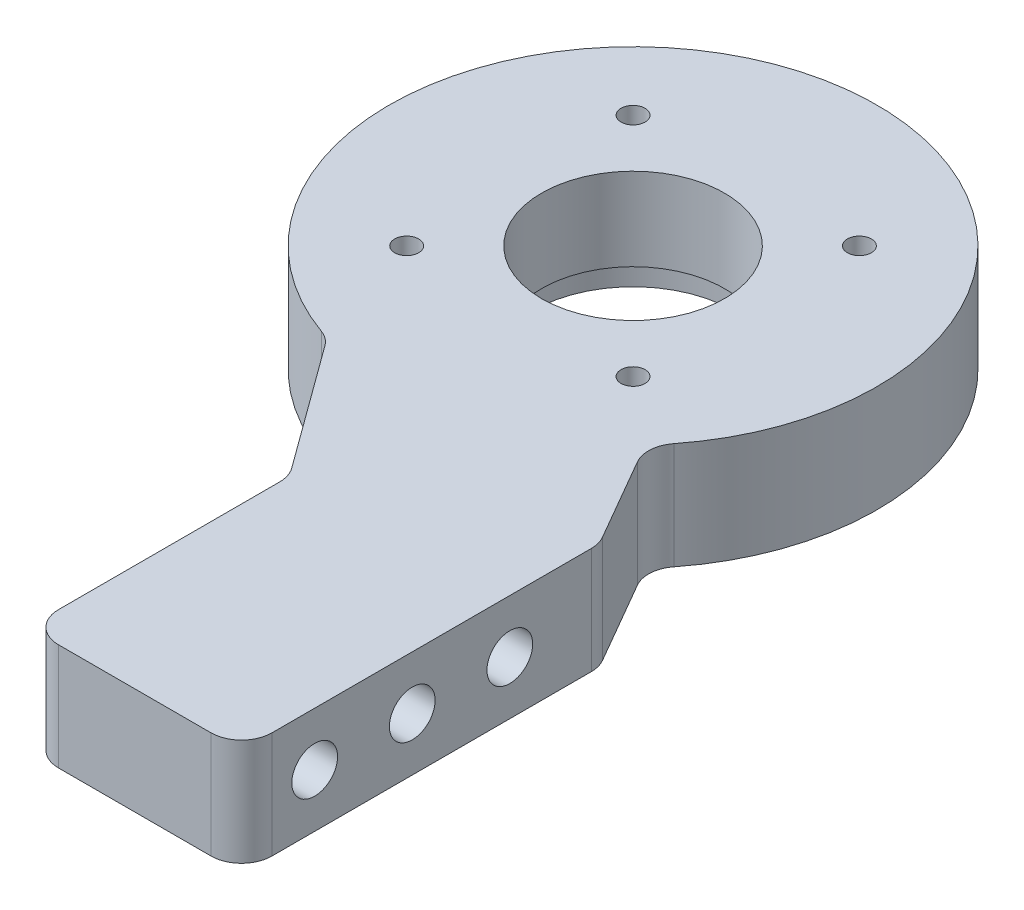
ISO-10303-21;
HEADER;
FILE_DESCRIPTION(('STEP AP214'),'2;1');
FILE_NAME('part.step','',(''),(''),'','','');
FILE_SCHEMA(('AUTOMOTIVE_DESIGN { 1 0 10303 214 1 1 1 1 }'));
ENDSEC;
DATA;
#1=APPLICATION_CONTEXT('core data for automotive mechanical design processes');
#2=APPLICATION_PROTOCOL_DEFINITION('international standard','automotive_design',2000,#1);
#3=PRODUCT_CONTEXT('',#1,'mechanical');
#4=PRODUCT('Part','Part','',(#3));
#5=PRODUCT_RELATED_PRODUCT_CATEGORY('part','',(#4));
#6=PRODUCT_DEFINITION_FORMATION('','',#4);
#7=PRODUCT_DEFINITION_CONTEXT('part definition',#1,'design');
#8=PRODUCT_DEFINITION('design','',#6,#7);
#9=PRODUCT_DEFINITION_SHAPE('','',#8);
#10=(LENGTH_UNIT() NAMED_UNIT(*) SI_UNIT(.MILLI.,.METRE.));
#11=(NAMED_UNIT(*) PLANE_ANGLE_UNIT() SI_UNIT($,.RADIAN.));
#12=(NAMED_UNIT(*) SI_UNIT($,.STERADIAN.) SOLID_ANGLE_UNIT());
#13=UNCERTAINTY_MEASURE_WITH_UNIT(LENGTH_MEASURE(1.E-05),#10,'distance_accuracy_value','');
#14=(GEOMETRIC_REPRESENTATION_CONTEXT(3) GLOBAL_UNCERTAINTY_ASSIGNED_CONTEXT((#13)) GLOBAL_UNIT_ASSIGNED_CONTEXT((#10,
#11,#12)) REPRESENTATION_CONTEXT('',''));
#15=CARTESIAN_POINT('',(0.,0.,0.));
#16=DIRECTION('',(0.,0.,1.));
#17=DIRECTION('',(1.,0.,0.));
#18=AXIS2_PLACEMENT_3D('',#15,#16,#17);
#19=CARTESIAN_POINT('',(0.,-15.875,-29.5166724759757));
#20=DIRECTION('',(0.,1.,0.));
#21=DIRECTION('',(0.,0.,1.));
#22=AXIS2_PLACEMENT_3D('',#19,#20,#21);
#23=CYLINDRICAL_SURFACE('',#22,19.05);
#24=CARTESIAN_POINT('',(0.,22.225,-29.5166724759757));
#25=DIRECTION('',(0.,1.,0.));
#26=DIRECTION('',(0.,0.,1.));
#27=AXIS2_PLACEMENT_3D('',#24,#25,#26);
#28=CIRCLE('',#27,19.05);
#29=CARTESIAN_POINT('',(0.,22.225,-10.4666724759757));
#30=VERTEX_POINT('',#29);
#31=EDGE_CURVE('E176',#30,#30,#28,.T.);
#32=CARTESIAN_POINT('',(0.,5.,-29.5166724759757));
#33=DIRECTION('',(0.,-1.,0.));
#34=DIRECTION('',(0.,0.,-1.));
#35=AXIS2_PLACEMENT_3D('',#32,#33,#34);
#36=CIRCLE('',#35,19.05);
#37=CARTESIAN_POINT('',(0.,5.,-10.4666724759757));
#38=VERTEX_POINT('',#37);
#39=EDGE_CURVE('E49',#38,#38,#36,.F.);
#40=CARTESIAN_POINT('',(0.,22.225,-10.4666724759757));
#41=CARTESIAN_POINT('',(0.,22.0455729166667,-10.4666724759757));
#42=CARTESIAN_POINT('',(0.,21.8661458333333,-10.4666724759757));
#43=CARTESIAN_POINT('',(0.,21.5072916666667,-10.4666724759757));
#44=CARTESIAN_POINT('',(0.,21.3278645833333,-10.4666724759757));
#45=CARTESIAN_POINT('',(0.,20.9690104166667,-10.4666724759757));
#46=CARTESIAN_POINT('',(0.,20.7895833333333,-10.4666724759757));
#47=CARTESIAN_POINT('',(0.,20.4307291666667,-10.4666724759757));
#48=CARTESIAN_POINT('',(0.,20.2513020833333,-10.4666724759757));
#49=CARTESIAN_POINT('',(0.,19.8924479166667,-10.4666724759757));
#50=CARTESIAN_POINT('',(0.,19.7130208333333,-10.4666724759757));
#51=CARTESIAN_POINT('',(0.,19.3541666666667,-10.4666724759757));
#52=CARTESIAN_POINT('',(0.,19.1747395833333,-10.4666724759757));
#53=CARTESIAN_POINT('',(0.,18.8158854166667,-10.4666724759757));
#54=CARTESIAN_POINT('',(0.,18.6364583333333,-10.4666724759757));
#55=CARTESIAN_POINT('',(0.,18.2776041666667,-10.4666724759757));
#56=CARTESIAN_POINT('',(0.,18.0981770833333,-10.4666724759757));
#57=CARTESIAN_POINT('',(0.,17.7393229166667,-10.4666724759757));
#58=CARTESIAN_POINT('',(0.,17.5598958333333,-10.4666724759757));
#59=CARTESIAN_POINT('',(0.,17.2010416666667,-10.4666724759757));
#60=CARTESIAN_POINT('',(0.,17.0216145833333,-10.4666724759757));
#61=CARTESIAN_POINT('',(0.,16.6627604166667,-10.4666724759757));
#62=CARTESIAN_POINT('',(0.,16.4833333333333,-10.4666724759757));
#63=CARTESIAN_POINT('',(0.,16.1244791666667,-10.4666724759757));
#64=CARTESIAN_POINT('',(0.,15.9450520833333,-10.4666724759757));
#65=CARTESIAN_POINT('',(0.,15.5861979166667,-10.4666724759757));
#66=CARTESIAN_POINT('',(0.,15.4067708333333,-10.4666724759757));
#67=CARTESIAN_POINT('',(0.,15.0479166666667,-10.4666724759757));
#68=CARTESIAN_POINT('',(0.,14.8684895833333,-10.4666724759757));
#69=CARTESIAN_POINT('',(0.,14.5096354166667,-10.4666724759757));
#70=CARTESIAN_POINT('',(0.,14.3302083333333,-10.4666724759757));
#71=CARTESIAN_POINT('',(0.,13.9713541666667,-10.4666724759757));
#72=CARTESIAN_POINT('',(0.,13.7919270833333,-10.4666724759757));
#73=CARTESIAN_POINT('',(0.,13.4330729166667,-10.4666724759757));
#74=CARTESIAN_POINT('',(0.,13.2536458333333,-10.4666724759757));
#75=CARTESIAN_POINT('',(0.,12.8947916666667,-10.4666724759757));
#76=CARTESIAN_POINT('',(0.,12.7153645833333,-10.4666724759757));
#77=CARTESIAN_POINT('',(0.,12.3565104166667,-10.4666724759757));
#78=CARTESIAN_POINT('',(0.,12.1770833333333,-10.4666724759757));
#79=CARTESIAN_POINT('',(0.,11.8182291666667,-10.4666724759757));
#80=CARTESIAN_POINT('',(0.,11.6388020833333,-10.4666724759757));
#81=CARTESIAN_POINT('',(0.,11.2799479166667,-10.4666724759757));
#82=CARTESIAN_POINT('',(0.,11.1005208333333,-10.4666724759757));
#83=CARTESIAN_POINT('',(0.,10.7416666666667,-10.4666724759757));
#84=CARTESIAN_POINT('',(0.,10.5622395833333,-10.4666724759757));
#85=CARTESIAN_POINT('',(0.,10.2033854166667,-10.4666724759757));
#86=CARTESIAN_POINT('',(0.,10.0239583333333,-10.4666724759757));
#87=CARTESIAN_POINT('',(0.,9.66510416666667,-10.4666724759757));
#88=CARTESIAN_POINT('',(0.,9.48567708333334,-10.4666724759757));
#89=CARTESIAN_POINT('',(0.,9.12682291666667,-10.4666724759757));
#90=CARTESIAN_POINT('',(0.,8.94739583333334,-10.4666724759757));
#91=CARTESIAN_POINT('',(0.,8.58854166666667,-10.4666724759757));
#92=CARTESIAN_POINT('',(0.,8.40911458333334,-10.4666724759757));
#93=CARTESIAN_POINT('',(0.,8.05026041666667,-10.4666724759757));
#94=CARTESIAN_POINT('',(0.,7.87083333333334,-10.4666724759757));
#95=CARTESIAN_POINT('',(0.,7.51197916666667,-10.4666724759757));
#96=CARTESIAN_POINT('',(0.,7.33255208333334,-10.4666724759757));
#97=CARTESIAN_POINT('',(0.,6.97369791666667,-10.4666724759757));
#98=CARTESIAN_POINT('',(0.,6.79427083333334,-10.4666724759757));
#99=CARTESIAN_POINT('',(0.,6.43541666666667,-10.4666724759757));
#100=CARTESIAN_POINT('',(0.,6.25598958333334,-10.4666724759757));
#101=CARTESIAN_POINT('',(0.,5.89713541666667,-10.4666724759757));
#102=CARTESIAN_POINT('',(0.,5.71770833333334,-10.4666724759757));
#103=CARTESIAN_POINT('',(0.,5.35885416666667,-10.4666724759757));
#104=CARTESIAN_POINT('',(0.,5.17942708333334,-10.4666724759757));
#105=CARTESIAN_POINT('',(0.,5.,-10.4666724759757));
#106=B_SPLINE_CURVE_WITH_KNOTS('',3,(#40,#41,#42,#43,#44,#45,#46,#47,#48,#49,#50,#51,#52,#53,
#54,#55,#56,#57,#58,#59,#60,#61,#62,#63,#64,#65,#66,#67,#68,#69,#70,#71,#72,#73,#74,#75,#76,#77,
#78,#79,#80,#81,#82,#83,#84,#85,#86,#87,#88,#89,#90,#91,#92,#93,#94,#95,#96,#97,#98,#99,#100,
#101,#102,#103,#104,#105),.UNSPECIFIED.,.F.,.F.,(4,2,2,2,2,2,2,2,2,2,2,2,2,2,2,2,2,2,2,2,2,2,2,
2,2,2,2,2,2,2,2,2,4),(0.,0.538281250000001,1.0765625,1.61484375,2.153125,2.69140625,3.2296875,
3.76796875,4.30625,4.84453125,5.3828125,5.92109375,6.459375,6.99765624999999,7.5359375,
8.07421875,8.6125,9.15078124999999,9.6890625,10.22734375,10.765625,11.30390625,11.8421875,
12.38046875,12.91875,13.45703125,13.9953125,14.53359375,15.071875,15.61015625,16.1484375,
16.68671875,17.225),.UNSPECIFIED.);
#107=EDGE_CURVE('BSEAM45',#30,#38,#106,.T.);
#108=ORIENTED_EDGE('',*,*,#31,.T.);
#109=ORIENTED_EDGE('',*,*,#39,.F.);
#110=ORIENTED_EDGE('',*,*,#107,.T.);
#111=ORIENTED_EDGE('',*,*,#107,.F.);
#112=EDGE_LOOP('',(#108,#110,#109,#111));
#113=FACE_BOUND('',#112,.T.);
#114=ADVANCED_FACE('F45',(#113),#23,.F.);
#115=CARTESIAN_POINT('',(0.,22.225,-29.5166724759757));
#116=DIRECTION('',(0.,-1.,0.));
#117=DIRECTION('',(0.,0.,-1.));
#118=AXIS2_PLACEMENT_3D('',#115,#116,#117);
#119=CYLINDRICAL_SURFACE('',#118,50.8);
#120=CARTESIAN_POINT('',(0.,0.,-29.5166724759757));
#121=DIRECTION('',(0.,1.,0.));
#122=DIRECTION('',(0.,0.,1.));
#123=AXIS2_PLACEMENT_3D('',#120,#121,#122);
#124=CIRCLE('',#123,50.8);
#125=CARTESIAN_POINT('',(39.9280779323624,0.,1.89015150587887));
#126=VERTEX_POINT('',#125);
#127=CARTESIAN_POINT('',(-17.0800590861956,0.,18.3258983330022));
#128=VERTEX_POINT('',#127);
#129=EDGE_CURVE('E169',#126,#128,#124,.T.);
#130=ORIENTED_EDGE('',*,*,#129,.T.);
#131=DIRECTION('',(0.,-1.,0.));
#132=VECTOR('',#131,1.);
#133=CARTESIAN_POINT('',(-17.0800590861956,22.225,18.3258983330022));
#134=LINE('',#133,#132);
#135=CARTESIAN_POINT('',(-17.0800590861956,22.225,18.3258983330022));
#136=VERTEX_POINT('',#135);
#137=EDGE_CURVE('E142',#128,#136,#134,.F.);
#138=ORIENTED_EDGE('',*,*,#137,.T.);
#139=CARTESIAN_POINT('',(0.,22.225,-29.5166724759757));
#140=DIRECTION('',(0.,1.,0.));
#141=DIRECTION('',(0.,0.,1.));
#142=AXIS2_PLACEMENT_3D('',#139,#140,#141);
#143=CIRCLE('',#142,50.8);
#144=CARTESIAN_POINT('',(39.9280779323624,22.225,1.89015150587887));
#145=VERTEX_POINT('',#144);
#146=EDGE_CURVE('E190',#145,#136,#143,.T.);
#147=ORIENTED_EDGE('',*,*,#146,.F.);
#148=DIRECTION('',(0.,-1.,0.));
#149=VECTOR('',#148,1.);
#150=CARTESIAN_POINT('',(39.9280779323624,22.225,1.89015150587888));
#151=LINE('',#150,#149);
#152=EDGE_CURVE('E160',#145,#126,#151,.T.);
#153=ORIENTED_EDGE('',*,*,#152,.T.);
#154=EDGE_LOOP('',(#130,#138,#147,#153));
#155=FACE_BOUND('',#154,.T.);
#156=ADVANCED_FACE('F261',(#155),#119,.T.);
#157=CARTESIAN_POINT('',(-15.2746276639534,22.225,18.9325354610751));
#158=DIRECTION('',(0.80798692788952,0.,-0.589200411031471));
#159=DIRECTION('',(-0.589200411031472,0.,-0.807986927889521));
#160=AXIS2_PLACEMENT_3D('',#157,#158,#159);
#161=PLANE('',#160);
#162=DIRECTION('',(0.589200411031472,0.,0.80798692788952));
#163=VECTOR('',#162,1.);
#164=CARTESIAN_POINT('',(-15.2746276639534,22.225,18.9325354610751));
#165=LINE('',#164,#163);
#166=CARTESIAN_POINT('',(-14.0843494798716,22.225,20.5647970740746));
#167=VERTEX_POINT('',#166);
#168=CARTESIAN_POINT('',(4.56083013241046,22.225,46.1334509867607));
#169=VERTEX_POINT('',#168);
#170=EDGE_CURVE('E158',#167,#169,#165,.T.);
#171=ORIENTED_EDGE('',*,*,#170,.F.);
#172=DIRECTION('',(0.,1.,0.));
#173=VECTOR('',#172,1.);
#174=CARTESIAN_POINT('',(-14.0843494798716,0.,20.5647970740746));
#175=LINE('',#174,#173);
#176=CARTESIAN_POINT('',(-14.0843494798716,0.,20.5647970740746));
#177=VERTEX_POINT('',#176);
#178=EDGE_CURVE('E141',#167,#177,#175,.F.);
#179=ORIENTED_EDGE('',*,*,#178,.T.);
#180=DIRECTION('',(0.589200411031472,0.,0.80798692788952));
#181=VECTOR('',#180,1.);
#182=CARTESIAN_POINT('',(-15.2746276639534,0.,18.9325354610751));
#183=LINE('',#182,#181);
#184=CARTESIAN_POINT('',(4.56083013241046,0.,46.1334509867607));
#185=VERTEX_POINT('',#184);
#186=EDGE_CURVE('E155',#177,#185,#183,.T.);
#187=ORIENTED_EDGE('',*,*,#186,.T.);
#188=DIRECTION('',(0.,-1.,0.));
#189=VECTOR('',#188,1.);
#190=CARTESIAN_POINT('',(4.56083013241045,22.225,46.1334509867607));
#191=LINE('',#190,#189);
#192=EDGE_CURVE('E161',#185,#169,#191,.F.);
#193=ORIENTED_EDGE('',*,*,#192,.T.);
#194=EDGE_LOOP('',(#171,#179,#187,#193));
#195=FACE_BOUND('',#194,.T.);
#196=ADVANCED_FACE('F154',(#195),#161,.F.);
#197=CARTESIAN_POINT('',(5.780113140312,22.225,47.8054877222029));
#198=DIRECTION('',(1.,0.,0.));
#199=DIRECTION('',(0.,0.,-1.));
#200=AXIS2_PLACEMENT_3D('',#197,#198,#199);
#201=PLANE('',#200);
#202=DIRECTION('',(0.,0.,1.));
#203=VECTOR('',#202,1.);
#204=CARTESIAN_POINT('',(5.780113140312,22.225,47.8054877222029));
#205=LINE('',#204,#203);
#206=CARTESIAN_POINT('',(5.780113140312,22.225,49.8748735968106));
#207=VERTEX_POINT('',#206);
#208=CARTESIAN_POINT('',(5.780113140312,22.225,95.9060503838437));
#209=VERTEX_POINT('',#208);
#210=EDGE_CURVE('E265',#207,#209,#205,.T.);
#211=ORIENTED_EDGE('',*,*,#210,.F.);
#212=DIRECTION('',(0.,-1.,0.));
#213=VECTOR('',#212,1.);
#214=CARTESIAN_POINT('',(5.780113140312,0.,49.8748735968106));
#215=LINE('',#214,#213);
#216=CARTESIAN_POINT('',(5.780113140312,0.,49.8748735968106));
#217=VERTEX_POINT('',#216);
#218=EDGE_CURVE('E202',#207,#217,#215,.T.);
#219=ORIENTED_EDGE('',*,*,#218,.T.);
#220=DIRECTION('',(0.,0.,1.));
#221=VECTOR('',#220,1.);
#222=CARTESIAN_POINT('',(5.780113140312,0.,47.8054877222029));
#223=LINE('',#222,#221);
#224=CARTESIAN_POINT('',(5.780113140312,0.,95.9060503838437));
#225=VERTEX_POINT('',#224);
#226=EDGE_CURVE('E168',#217,#225,#223,.T.);
#227=ORIENTED_EDGE('',*,*,#226,.T.);
#228=DIRECTION('',(0.,-1.,0.));
#229=VECTOR('',#228,1.);
#230=CARTESIAN_POINT('',(5.780113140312,22.225,95.9060503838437));
#231=LINE('',#230,#229);
#232=EDGE_CURVE('E199',#225,#209,#231,.F.);
#233=ORIENTED_EDGE('',*,*,#232,.T.);
#234=EDGE_LOOP('',(#211,#219,#227,#233));
#235=FACE_BOUND('',#234,.T.);
#236=ADVANCED_FACE('F301',(#235),#201,.F.);
#237=CARTESIAN_POINT('',(22.8391638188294,22.225,102.256050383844));
#238=DIRECTION('',(0.,0.,-1.));
#239=DIRECTION('',(-1.,0.,0.));
#240=AXIS2_PLACEMENT_3D('',#237,#238,#239);
#241=PLANE('',#240);
#242=DIRECTION('',(1.,0.,0.));
#243=VECTOR('',#242,1.);
#244=CARTESIAN_POINT('',(5.780113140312,22.225,102.256050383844));
#245=LINE('',#244,#243);
#246=CARTESIAN_POINT('',(12.130113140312,22.225,102.256050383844));
#247=VERTEX_POINT('',#246);
#248=CARTESIAN_POINT('',(43.880113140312,22.225,102.256050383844));
#249=VERTEX_POINT('',#248);
#250=EDGE_CURVE('E272',#247,#249,#245,.T.);
#251=ORIENTED_EDGE('',*,*,#250,.F.);
#252=DIRECTION('',(0.,-1.,0.));
#253=VECTOR('',#252,1.);
#254=CARTESIAN_POINT('',(12.130113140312,22.225,102.256050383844));
#255=LINE('',#254,#253);
#256=CARTESIAN_POINT('',(12.130113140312,0.,102.256050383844));
#257=VERTEX_POINT('',#256);
#258=EDGE_CURVE('E209',#247,#257,#255,.T.);
#259=ORIENTED_EDGE('',*,*,#258,.T.);
#260=DIRECTION('',(1.,0.,0.));
#261=VECTOR('',#260,1.);
#262=CARTESIAN_POINT('',(22.8391638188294,0.,102.256050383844));
#263=LINE('',#262,#261);
#264=CARTESIAN_POINT('',(43.880113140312,0.,102.256050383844));
#265=VERTEX_POINT('',#264);
#266=EDGE_CURVE('E174',#257,#265,#263,.T.);
#267=ORIENTED_EDGE('',*,*,#266,.T.);
#268=DIRECTION('',(0.,-1.,0.));
#269=VECTOR('',#268,1.);
#270=CARTESIAN_POINT('',(43.880113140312,22.225,102.256050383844));
#271=LINE('',#270,#269);
#272=EDGE_CURVE('E206',#265,#249,#271,.F.);
#273=ORIENTED_EDGE('',*,*,#272,.T.);
#274=EDGE_LOOP('',(#251,#259,#267,#273));
#275=FACE_BOUND('',#274,.T.);
#276=ADVANCED_FACE('F293',(#275),#241,.F.);
#277=CARTESIAN_POINT('',(50.230113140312,22.225,80.3166724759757));
#278=DIRECTION('',(-1.,0.,0.));
#279=DIRECTION('',(0.,0.,1.));
#280=AXIS2_PLACEMENT_3D('',#277,#278,#279);
#281=PLANE('',#280);
#282=CARTESIAN_POINT('',(50.230113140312,11.1125,87.0160503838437));
#283=DIRECTION('',(1.,0.,0.));
#284=DIRECTION('',(0.,0.,-1.));
#285=AXIS2_PLACEMENT_3D('',#282,#283,#284);
#286=CIRCLE('',#285,4.7625);
#287=CARTESIAN_POINT('',(50.230113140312,11.1125,82.2535503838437));
#288=VERTEX_POINT('',#287);
#289=EDGE_CURVE('E629',#288,#288,#286,.T.);
#290=ORIENTED_EDGE('',*,*,#289,.F.);
#291=EDGE_LOOP('',(#290));
#292=FACE_BOUND('',#291,.T.);
#293=CARTESIAN_POINT('',(50.230113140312,11.1125,66.6960503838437));
#294=DIRECTION('',(1.,0.,0.));
#295=DIRECTION('',(0.,0.,-1.));
#296=AXIS2_PLACEMENT_3D('',#293,#294,#295);
#297=CIRCLE('',#296,4.7625);
#298=CARTESIAN_POINT('',(50.230113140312,11.1125,61.9335503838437));
#299=VERTEX_POINT('',#298);
#300=EDGE_CURVE('E625',#299,#299,#297,.T.);
#301=ORIENTED_EDGE('',*,*,#300,.F.);
#302=EDGE_LOOP('',(#301));
#303=FACE_BOUND('',#302,.T.);
#304=CARTESIAN_POINT('',(50.230113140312,11.1125,46.3760503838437));
#305=DIRECTION('',(1.,0.,0.));
#306=DIRECTION('',(0.,0.,-1.));
#307=AXIS2_PLACEMENT_3D('',#304,#305,#306);
#308=CIRCLE('',#307,4.7625);
#309=CARTESIAN_POINT('',(50.230113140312,11.1125,41.6135503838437));
#310=VERTEX_POINT('',#309);
#311=EDGE_CURVE('E617',#310,#310,#308,.T.);
#312=ORIENTED_EDGE('',*,*,#311,.F.);
#313=EDGE_LOOP('',(#312));
#314=FACE_BOUND('',#313,.T.);
#315=DIRECTION('',(0.,0.,-1.));
#316=VECTOR('',#315,1.);
#317=CARTESIAN_POINT('',(50.230113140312,22.225,102.256050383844));
#318=LINE('',#317,#316);
#319=CARTESIAN_POINT('',(50.230113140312,22.225,95.9060503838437));
#320=VERTEX_POINT('',#319);
#321=CARTESIAN_POINT('',(50.230113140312,22.225,29.4164478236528));
#322=VERTEX_POINT('',#321);
#323=EDGE_CURVE('E276',#320,#322,#318,.T.);
#324=ORIENTED_EDGE('',*,*,#323,.F.);
#325=DIRECTION('',(0.,-1.,0.));
#326=VECTOR('',#325,1.);
#327=CARTESIAN_POINT('',(50.230113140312,22.225,95.9060503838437));
#328=LINE('',#327,#326);
#329=CARTESIAN_POINT('',(50.230113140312,0.,95.9060503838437));
#330=VERTEX_POINT('',#329);
#331=EDGE_CURVE('E233',#320,#330,#328,.T.);
#332=ORIENTED_EDGE('',*,*,#331,.T.);
#333=DIRECTION('',(0.,0.,-1.));
#334=VECTOR('',#333,1.);
#335=CARTESIAN_POINT('',(50.230113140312,0.,80.3166724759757));
#336=LINE('',#335,#334);
#337=CARTESIAN_POINT('',(50.230113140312,0.,29.4164478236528));
#338=VERTEX_POINT('',#337);
#339=EDGE_CURVE('E183',#330,#338,#336,.T.);
#340=ORIENTED_EDGE('',*,*,#339,.T.);
#341=DIRECTION('',(0.,-1.,0.));
#342=VECTOR('',#341,1.);
#343=CARTESIAN_POINT('',(50.230113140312,22.225,29.4164478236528));
#344=LINE('',#343,#342);
#345=EDGE_CURVE('E230',#338,#322,#344,.F.);
#346=ORIENTED_EDGE('',*,*,#345,.T.);
#347=EDGE_LOOP('',(#324,#332,#340,#346));
#348=FACE_BOUND('',#347,.T.);
#349=ADVANCED_FACE('F287',(#292,#303,#314,#348),#281,.F.);
#350=CARTESIAN_POINT('',(50.230113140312,22.225,27.7149704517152));
#351=DIRECTION('',(-0.866025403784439,0.,0.5));
#352=DIRECTION('',(0.5,0.,0.866025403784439));
#353=AXIS2_PLACEMENT_3D('',#350,#351,#352);
#354=PLANE('',#353);
#355=DIRECTION('',(-0.5,0.,-0.866025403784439));
#356=VECTOR('',#355,1.);
#357=CARTESIAN_POINT('',(50.230113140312,22.225,27.7149704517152));
#358=LINE('',#357,#356);
#359=CARTESIAN_POINT('',(49.3793744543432,22.225,26.2414478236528));
#360=VERTEX_POINT('',#359);
#361=CARTESIAN_POINT('',(39.4198263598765,22.225,8.9910045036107));
#362=VERTEX_POINT('',#361);
#363=EDGE_CURVE('E192',#360,#362,#358,.T.);
#364=ORIENTED_EDGE('',*,*,#363,.F.);
#365=DIRECTION('',(0.,-1.,0.));
#366=VECTOR('',#365,1.);
#367=CARTESIAN_POINT('',(49.3793744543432,22.225,26.2414478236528));
#368=LINE('',#367,#366);
#369=CARTESIAN_POINT('',(49.3793744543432,0.,26.2414478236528));
#370=VERTEX_POINT('',#369);
#371=EDGE_CURVE('E149',#360,#370,#368,.T.);
#372=ORIENTED_EDGE('',*,*,#371,.T.);
#373=DIRECTION('',(-0.5,0.,-0.866025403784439));
#374=VECTOR('',#373,1.);
#375=CARTESIAN_POINT('',(50.230113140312,0.,27.7149704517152));
#376=LINE('',#375,#374);
#377=CARTESIAN_POINT('',(39.4198263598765,0.,8.9910045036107));
#378=VERTEX_POINT('',#377);
#379=EDGE_CURVE('E187',#370,#378,#376,.T.);
#380=ORIENTED_EDGE('',*,*,#379,.T.);
#381=DIRECTION('',(0.,1.,0.));
#382=VECTOR('',#381,1.);
#383=CARTESIAN_POINT('',(39.4198263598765,22.225,8.9910045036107));
#384=LINE('',#383,#382);
#385=EDGE_CURVE('E62',#378,#362,#384,.T.);
#386=ORIENTED_EDGE('',*,*,#385,.T.);
#387=EDGE_LOOP('',(#364,#372,#380,#386));
#388=FACE_BOUND('',#387,.T.);
#389=ADVANCED_FACE('F253',(#388),#354,.F.);
#390=CARTESIAN_POINT('',(0.,22.225,-29.5166724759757));
#391=DIRECTION('',(0.,1.,0.));
#392=DIRECTION('',(0.,0.,1.));
#393=AXIS2_PLACEMENT_3D('',#390,#391,#392);
#394=PLANE('',#393);
#395=CARTESIAN_POINT('',(23.57,22.225,-5.9466724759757));
#396=DIRECTION('',(0.,1.,0.));
#397=DIRECTION('',(0.,0.,1.));
#398=AXIS2_PLACEMENT_3D('',#395,#396,#397);
#399=CIRCLE('',#398,2.5);
#400=CARTESIAN_POINT('',(23.57,22.225,-8.4466724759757));
#401=VERTEX_POINT('',#400);
#402=EDGE_CURVE('E515',#401,#401,#399,.T.);
#403=ORIENTED_EDGE('',*,*,#402,.F.);
#404=EDGE_LOOP('',(#403));
#405=FACE_BOUND('',#404,.T.);
#406=CARTESIAN_POINT('',(-23.57,22.225,-53.0866724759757));
#407=DIRECTION('',(0.,1.,0.));
#408=DIRECTION('',(0.,0.,1.));
#409=AXIS2_PLACEMENT_3D('',#406,#407,#408);
#410=CIRCLE('',#409,2.5);
#411=CARTESIAN_POINT('',(-23.57,22.225,-55.5866724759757));
#412=VERTEX_POINT('',#411);
#413=EDGE_CURVE('E485',#412,#412,#410,.T.);
#414=ORIENTED_EDGE('',*,*,#413,.F.);
#415=EDGE_LOOP('',(#414));
#416=FACE_BOUND('',#415,.T.);
#417=CARTESIAN_POINT('',(23.57,22.225,-53.0866724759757));
#418=DIRECTION('',(0.,1.,0.));
#419=DIRECTION('',(0.,0.,1.));
#420=AXIS2_PLACEMENT_3D('',#417,#418,#419);
#421=CIRCLE('',#420,2.5);
#422=CARTESIAN_POINT('',(23.57,22.225,-55.5866724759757));
#423=VERTEX_POINT('',#422);
#424=EDGE_CURVE('E510',#423,#423,#421,.T.);
#425=ORIENTED_EDGE('',*,*,#424,.F.);
#426=EDGE_LOOP('',(#425));
#427=FACE_BOUND('',#426,.T.);
#428=CARTESIAN_POINT('',(-23.57,22.225,-5.9466724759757));
#429=DIRECTION('',(0.,1.,0.));
#430=DIRECTION('',(0.,0.,1.));
#431=AXIS2_PLACEMENT_3D('',#428,#429,#430);
#432=CIRCLE('',#431,2.5);
#433=CARTESIAN_POINT('',(-23.57,22.225,-8.4466724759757));
#434=VERTEX_POINT('',#433);
#435=EDGE_CURVE('E506',#434,#434,#432,.T.);
#436=ORIENTED_EDGE('',*,*,#435,.F.);
#437=EDGE_LOOP('',(#436));
#438=FACE_BOUND('',#437,.T.);
#439=ORIENTED_EDGE('',*,*,#31,.F.);
#440=EDGE_LOOP('',(#439));
#441=FACE_BOUND('',#440,.T.);
#442=ORIENTED_EDGE('',*,*,#210,.T.);
#443=CARTESIAN_POINT('',(12.130113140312,22.225,95.9060503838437));
#444=DIRECTION('',(0.,1.,0.));
#445=DIRECTION('',(0.,0.,1.));
#446=AXIS2_PLACEMENT_3D('',#443,#444,#445);
#447=CIRCLE('',#446,6.35);
#448=EDGE_CURVE('E227',#209,#247,#447,.T.);
#449=ORIENTED_EDGE('',*,*,#448,.T.);
#450=ORIENTED_EDGE('',*,*,#250,.T.);
#451=CARTESIAN_POINT('',(43.880113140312,22.225,95.9060503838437));
#452=DIRECTION('',(0.,1.,0.));
#453=DIRECTION('',(0.,0.,1.));
#454=AXIS2_PLACEMENT_3D('',#451,#452,#453);
#455=CIRCLE('',#454,6.35);
#456=EDGE_CURVE('E224',#249,#320,#455,.T.);
#457=ORIENTED_EDGE('',*,*,#456,.T.);
#458=ORIENTED_EDGE('',*,*,#323,.T.);
#459=CARTESIAN_POINT('',(43.880113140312,22.225,29.4164478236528));
#460=DIRECTION('',(0.,1.,0.));
#461=DIRECTION('',(0.,0.,1.));
#462=AXIS2_PLACEMENT_3D('',#459,#460,#461);
#463=CIRCLE('',#462,6.35);
#464=EDGE_CURVE('E69',#322,#360,#463,.T.);
#465=ORIENTED_EDGE('',*,*,#464,.T.);
#466=ORIENTED_EDGE('',*,*,#363,.T.);
#467=CARTESIAN_POINT('',(44.9190876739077,22.225,5.8160045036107));
#468=DIRECTION('',(0.,1.,0.));
#469=DIRECTION('',(0.,0.,1.));
#470=AXIS2_PLACEMENT_3D('',#467,#468,#469);
#471=CIRCLE('',#470,6.35);
#472=EDGE_CURVE('E11',#362,#145,#471,.F.);
#473=ORIENTED_EDGE('',*,*,#472,.T.);
#474=ORIENTED_EDGE('',*,*,#146,.T.);
#475=CARTESIAN_POINT('',(-19.21506647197,22.225,24.3062196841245));
#476=DIRECTION('',(0.,1.,0.));
#477=DIRECTION('',(0.,0.,1.));
#478=AXIS2_PLACEMENT_3D('',#475,#476,#477);
#479=CIRCLE('',#478,6.35);
#480=EDGE_CURVE('E148',#136,#167,#479,.F.);
#481=ORIENTED_EDGE('',*,*,#480,.T.);
#482=ORIENTED_EDGE('',*,*,#170,.T.);
#483=CARTESIAN_POINT('',(-0.569886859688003,22.225,49.8748735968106));
#484=DIRECTION('',(0.,1.,0.));
#485=DIRECTION('',(0.,0.,1.));
#486=AXIS2_PLACEMENT_3D('',#483,#484,#485);
#487=CIRCLE('',#486,6.35);
#488=EDGE_CURVE('E246',#169,#207,#487,.F.);
#489=ORIENTED_EDGE('',*,*,#488,.T.);
#490=EDGE_LOOP('',(#442,#449,#450,#457,#458,#465,#466,#473,#474,#481,#482,#489));
#491=FACE_BOUND('',#490,.T.);
#492=ADVANCED_FACE('F259',(#405,#416,#427,#438,#441,#491),#394,.T.);
#493=CARTESIAN_POINT('',(0.,0.,-29.5166724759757));
#494=DIRECTION('',(0.,1.,0.));
#495=DIRECTION('',(0.,0.,1.));
#496=AXIS2_PLACEMENT_3D('',#493,#494,#495);
#497=PLANE('',#496);
#498=CARTESIAN_POINT('',(0.,0.,-29.5166724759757));
#499=DIRECTION('',(0.,-1.,0.));
#500=DIRECTION('',(0.,0.,-1.));
#501=AXIS2_PLACEMENT_3D('',#498,#499,#500);
#502=CIRCLE('',#501,21.);
#503=CARTESIAN_POINT('',(0.,0.,-50.5166724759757));
#504=VERTEX_POINT('',#503);
#505=EDGE_CURVE('E636',#504,#504,#502,.T.);
#506=ORIENTED_EDGE('',*,*,#505,.F.);
#507=EDGE_LOOP('',(#506));
#508=FACE_BOUND('',#507,.T.);
#509=CARTESIAN_POINT('',(23.57,0.,-5.9466724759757));
#510=DIRECTION('',(0.,-1.,0.));
#511=DIRECTION('',(0.,0.,-1.));
#512=AXIS2_PLACEMENT_3D('',#509,#510,#511);
#513=CIRCLE('',#512,2.5);
#514=CARTESIAN_POINT('',(23.57,0.,-8.4466724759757));
#515=VERTEX_POINT('',#514);
#516=EDGE_CURVE('E491',#515,#515,#513,.T.);
#517=ORIENTED_EDGE('',*,*,#516,.F.);
#518=EDGE_LOOP('',(#517));
#519=FACE_BOUND('',#518,.T.);
#520=CARTESIAN_POINT('',(-23.57,0.,-53.0866724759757));
#521=DIRECTION('',(0.,-1.,0.));
#522=DIRECTION('',(0.,0.,-1.));
#523=AXIS2_PLACEMENT_3D('',#520,#521,#522);
#524=CIRCLE('',#523,2.5);
#525=CARTESIAN_POINT('',(-23.57,0.,-55.5866724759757));
#526=VERTEX_POINT('',#525);
#527=EDGE_CURVE('E488',#526,#526,#524,.T.);
#528=ORIENTED_EDGE('',*,*,#527,.F.);
#529=EDGE_LOOP('',(#528));
#530=FACE_BOUND('',#529,.T.);
#531=CARTESIAN_POINT('',(23.57,0.,-53.0866724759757));
#532=DIRECTION('',(0.,-1.,0.));
#533=DIRECTION('',(0.,0.,-1.));
#534=AXIS2_PLACEMENT_3D('',#531,#532,#533);
#535=CIRCLE('',#534,2.5);
#536=CARTESIAN_POINT('',(23.57,0.,-55.5866724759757));
#537=VERTEX_POINT('',#536);
#538=EDGE_CURVE('E492',#537,#537,#535,.T.);
#539=ORIENTED_EDGE('',*,*,#538,.F.);
#540=EDGE_LOOP('',(#539));
#541=FACE_BOUND('',#540,.T.);
#542=CARTESIAN_POINT('',(-23.57,0.,-5.9466724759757));
#543=DIRECTION('',(0.,-1.,0.));
#544=DIRECTION('',(0.,0.,-1.));
#545=AXIS2_PLACEMENT_3D('',#542,#543,#544);
#546=CIRCLE('',#545,2.5);
#547=CARTESIAN_POINT('',(-23.57,0.,-8.4466724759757));
#548=VERTEX_POINT('',#547);
#549=EDGE_CURVE('E497',#548,#548,#546,.T.);
#550=ORIENTED_EDGE('',*,*,#549,.F.);
#551=EDGE_LOOP('',(#550));
#552=FACE_BOUND('',#551,.T.);
#553=ORIENTED_EDGE('',*,*,#266,.F.);
#554=CARTESIAN_POINT('',(12.130113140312,0.,95.9060503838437));
#555=DIRECTION('',(0.,1.,0.));
#556=DIRECTION('',(0.,0.,1.));
#557=AXIS2_PLACEMENT_3D('',#554,#555,#556);
#558=CIRCLE('',#557,6.35);
#559=EDGE_CURVE('E219',#257,#225,#558,.F.);
#560=ORIENTED_EDGE('',*,*,#559,.T.);
#561=ORIENTED_EDGE('',*,*,#226,.F.);
#562=CARTESIAN_POINT('',(-0.569886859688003,0.,49.8748735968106));
#563=DIRECTION('',(0.,1.,0.));
#564=DIRECTION('',(0.,0.,1.));
#565=AXIS2_PLACEMENT_3D('',#562,#563,#564);
#566=CIRCLE('',#565,6.35);
#567=EDGE_CURVE('E166',#217,#185,#566,.T.);
#568=ORIENTED_EDGE('',*,*,#567,.T.);
#569=ORIENTED_EDGE('',*,*,#186,.F.);
#570=CARTESIAN_POINT('',(-19.21506647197,0.,24.3062196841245));
#571=DIRECTION('',(0.,1.,0.));
#572=DIRECTION('',(0.,0.,1.));
#573=AXIS2_PLACEMENT_3D('',#570,#571,#572);
#574=CIRCLE('',#573,6.35);
#575=EDGE_CURVE('E137',#177,#128,#574,.T.);
#576=ORIENTED_EDGE('',*,*,#575,.T.);
#577=ORIENTED_EDGE('',*,*,#129,.F.);
#578=CARTESIAN_POINT('',(44.9190876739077,0.,5.8160045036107));
#579=DIRECTION('',(0.,1.,0.));
#580=DIRECTION('',(0.,0.,1.));
#581=AXIS2_PLACEMENT_3D('',#578,#579,#580);
#582=CIRCLE('',#581,6.35);
#583=EDGE_CURVE('E55',#126,#378,#582,.T.);
#584=ORIENTED_EDGE('',*,*,#583,.T.);
#585=ORIENTED_EDGE('',*,*,#379,.F.);
#586=CARTESIAN_POINT('',(43.880113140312,0.,29.4164478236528));
#587=DIRECTION('',(0.,1.,0.));
#588=DIRECTION('',(0.,0.,1.));
#589=AXIS2_PLACEMENT_3D('',#586,#587,#588);
#590=CIRCLE('',#589,6.35);
#591=EDGE_CURVE('E213',#370,#338,#590,.F.);
#592=ORIENTED_EDGE('',*,*,#591,.T.);
#593=ORIENTED_EDGE('',*,*,#339,.F.);
#594=CARTESIAN_POINT('',(43.880113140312,0.,95.9060503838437));
#595=DIRECTION('',(0.,1.,0.));
#596=DIRECTION('',(0.,0.,1.));
#597=AXIS2_PLACEMENT_3D('',#594,#595,#596);
#598=CIRCLE('',#597,6.35);
#599=EDGE_CURVE('E216',#330,#265,#598,.F.);
#600=ORIENTED_EDGE('',*,*,#599,.T.);
#601=EDGE_LOOP('',(#553,#560,#561,#568,#569,#576,#577,#584,#585,#592,#593,#600));
#602=FACE_BOUND('',#601,.T.);
#603=ADVANCED_FACE('F164',(#508,#519,#530,#541,#552,#602),#497,.F.);
#604=CARTESIAN_POINT('',(-23.57,42.672,-5.9466724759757));
#605=DIRECTION('',(0.,-1.,0.));
#606=DIRECTION('',(0.,0.,-1.));
#607=AXIS2_PLACEMENT_3D('',#604,#605,#606);
#608=CYLINDRICAL_SURFACE('',#607,2.5);
#609=CARTESIAN_POINT('',(-23.57,22.225,-8.4466724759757));
#610=CARTESIAN_POINT('',(-23.57,21.9934895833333,-8.4466724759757));
#611=CARTESIAN_POINT('',(-23.57,21.7619791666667,-8.4466724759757));
#612=CARTESIAN_POINT('',(-23.57,21.2989583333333,-8.4466724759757));
#613=CARTESIAN_POINT('',(-23.57,21.0674479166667,-8.4466724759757));
#614=CARTESIAN_POINT('',(-23.57,20.6044270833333,-8.4466724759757));
#615=CARTESIAN_POINT('',(-23.57,20.3729166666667,-8.4466724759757));
#616=CARTESIAN_POINT('',(-23.57,19.9098958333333,-8.4466724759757));
#617=CARTESIAN_POINT('',(-23.57,19.6783854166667,-8.4466724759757));
#618=CARTESIAN_POINT('',(-23.57,19.2153645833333,-8.4466724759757));
#619=CARTESIAN_POINT('',(-23.57,18.9838541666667,-8.4466724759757));
#620=CARTESIAN_POINT('',(-23.57,18.5208333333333,-8.4466724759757));
#621=CARTESIAN_POINT('',(-23.57,18.2893229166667,-8.4466724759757));
#622=CARTESIAN_POINT('',(-23.57,17.8263020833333,-8.4466724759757));
#623=CARTESIAN_POINT('',(-23.57,17.5947916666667,-8.4466724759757));
#624=CARTESIAN_POINT('',(-23.57,17.1317708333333,-8.4466724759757));
#625=CARTESIAN_POINT('',(-23.57,16.9002604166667,-8.4466724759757));
#626=CARTESIAN_POINT('',(-23.57,16.4372395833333,-8.4466724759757));
#627=CARTESIAN_POINT('',(-23.57,16.2057291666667,-8.4466724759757));
#628=CARTESIAN_POINT('',(-23.57,15.7427083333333,-8.4466724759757));
#629=CARTESIAN_POINT('',(-23.57,15.5111979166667,-8.4466724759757));
#630=CARTESIAN_POINT('',(-23.57,15.0481770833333,-8.4466724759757));
#631=CARTESIAN_POINT('',(-23.57,14.8166666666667,-8.4466724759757));
#632=CARTESIAN_POINT('',(-23.57,14.3536458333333,-8.4466724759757));
#633=CARTESIAN_POINT('',(-23.57,14.1221354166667,-8.4466724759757));
#634=CARTESIAN_POINT('',(-23.57,13.6591145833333,-8.4466724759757));
#635=CARTESIAN_POINT('',(-23.57,13.4276041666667,-8.4466724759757));
#636=CARTESIAN_POINT('',(-23.57,12.9645833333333,-8.4466724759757));
#637=CARTESIAN_POINT('',(-23.57,12.7330729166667,-8.4466724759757));
#638=CARTESIAN_POINT('',(-23.57,12.2700520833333,-8.4466724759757));
#639=CARTESIAN_POINT('',(-23.57,12.0385416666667,-8.4466724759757));
#640=CARTESIAN_POINT('',(-23.57,11.5755208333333,-8.4466724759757));
#641=CARTESIAN_POINT('',(-23.57,11.3440104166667,-8.4466724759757));
#642=CARTESIAN_POINT('',(-23.57,10.8809895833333,-8.4466724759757));
#643=CARTESIAN_POINT('',(-23.57,10.6494791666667,-8.4466724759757));
#644=CARTESIAN_POINT('',(-23.57,10.1864583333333,-8.4466724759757));
#645=CARTESIAN_POINT('',(-23.57,9.95494791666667,-8.4466724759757));
#646=CARTESIAN_POINT('',(-23.57,9.49192708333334,-8.4466724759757));
#647=CARTESIAN_POINT('',(-23.57,9.26041666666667,-8.4466724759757));
#648=CARTESIAN_POINT('',(-23.57,8.79739583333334,-8.4466724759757));
#649=CARTESIAN_POINT('',(-23.57,8.56588541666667,-8.4466724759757));
#650=CARTESIAN_POINT('',(-23.57,8.10286458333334,-8.4466724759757));
#651=CARTESIAN_POINT('',(-23.57,7.87135416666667,-8.4466724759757));
#652=CARTESIAN_POINT('',(-23.57,7.40833333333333,-8.4466724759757));
#653=CARTESIAN_POINT('',(-23.57,7.17682291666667,-8.4466724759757));
#654=CARTESIAN_POINT('',(-23.57,6.71380208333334,-8.4466724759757));
#655=CARTESIAN_POINT('',(-23.57,6.48229166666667,-8.4466724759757));
#656=CARTESIAN_POINT('',(-23.57,6.01927083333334,-8.4466724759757));
#657=CARTESIAN_POINT('',(-23.57,5.78776041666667,-8.4466724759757));
#658=CARTESIAN_POINT('',(-23.57,5.32473958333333,-8.4466724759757));
#659=CARTESIAN_POINT('',(-23.57,5.09322916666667,-8.4466724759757));
#660=CARTESIAN_POINT('',(-23.57,4.63020833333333,-8.4466724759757));
#661=CARTESIAN_POINT('',(-23.57,4.39869791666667,-8.4466724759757));
#662=CARTESIAN_POINT('',(-23.57,3.93567708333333,-8.4466724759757));
#663=CARTESIAN_POINT('',(-23.57,3.70416666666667,-8.4466724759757));
#664=CARTESIAN_POINT('',(-23.57,3.24114583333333,-8.4466724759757));
#665=CARTESIAN_POINT('',(-23.57,3.00963541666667,-8.4466724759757));
#666=CARTESIAN_POINT('',(-23.57,2.54661458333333,-8.4466724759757));
#667=CARTESIAN_POINT('',(-23.57,2.31510416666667,-8.4466724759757));
#668=CARTESIAN_POINT('',(-23.57,1.85208333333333,-8.4466724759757));
#669=CARTESIAN_POINT('',(-23.57,1.62057291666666,-8.4466724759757));
#670=CARTESIAN_POINT('',(-23.57,1.15755208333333,-8.4466724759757));
#671=CARTESIAN_POINT('',(-23.57,0.926041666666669,-8.4466724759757));
#672=CARTESIAN_POINT('',(-23.57,0.463020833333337,-8.4466724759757));
#673=CARTESIAN_POINT('',(-23.57,0.231510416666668,-8.4466724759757));
#674=CARTESIAN_POINT('',(-23.57,0.,-8.4466724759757));
#675=B_SPLINE_CURVE_WITH_KNOTS('',3,(#609,#610,#611,#612,#613,#614,#615,#616,#617,#618,#619,
#620,#621,#622,#623,#624,#625,#626,#627,#628,#629,#630,#631,#632,#633,#634,#635,#636,#637,#638,
#639,#640,#641,#642,#643,#644,#645,#646,#647,#648,#649,#650,#651,#652,#653,#654,#655,#656,#657,
#658,#659,#660,#661,#662,#663,#664,#665,#666,#667,#668,#669,#670,#671,#672,#673,#674),
.UNSPECIFIED.,.F.,.F.,(4,2,2,2,2,2,2,2,2,2,2,2,2,2,2,2,2,2,2,2,2,2,2,2,2,2,2,2,2,2,2,2,4),(0.,
0.694531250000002,1.3890625,2.08359375,2.778125,3.47265625,4.1671875,4.86171875,5.55625,
6.25078125,6.9453125,7.63984375,8.334375,9.02890625,9.7234375,10.41796875,11.1125,11.80703125,
12.5015625,13.19609375,13.890625,14.58515625,15.2796875,15.97421875,16.66875,17.36328125,
18.0578125,18.75234375,19.446875,20.14140625,20.8359375,21.53046875,22.225),.UNSPECIFIED.);
#676=EDGE_CURVE('BSEAM328',#434,#548,#675,.T.);
#677=ORIENTED_EDGE('',*,*,#435,.T.);
#678=ORIENTED_EDGE('',*,*,#549,.T.);
#679=ORIENTED_EDGE('',*,*,#676,.T.);
#680=ORIENTED_EDGE('',*,*,#676,.F.);
#681=EDGE_LOOP('',(#677,#679,#678,#680));
#682=FACE_BOUND('',#681,.T.);
#683=ADVANCED_FACE('F328',(#682),#608,.F.);
#684=CARTESIAN_POINT('',(23.57,42.672,-53.0866724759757));
#685=DIRECTION('',(0.,-1.,0.));
#686=DIRECTION('',(0.,0.,-1.));
#687=AXIS2_PLACEMENT_3D('',#684,#685,#686);
#688=CYLINDRICAL_SURFACE('',#687,2.5);
#689=CARTESIAN_POINT('',(23.57,22.225,-55.5866724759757));
#690=CARTESIAN_POINT('',(23.57,21.9934895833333,-55.5866724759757));
#691=CARTESIAN_POINT('',(23.57,21.7619791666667,-55.5866724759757));
#692=CARTESIAN_POINT('',(23.57,21.2989583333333,-55.5866724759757));
#693=CARTESIAN_POINT('',(23.57,21.0674479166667,-55.5866724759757));
#694=CARTESIAN_POINT('',(23.57,20.6044270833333,-55.5866724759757));
#695=CARTESIAN_POINT('',(23.57,20.3729166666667,-55.5866724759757));
#696=CARTESIAN_POINT('',(23.57,19.9098958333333,-55.5866724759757));
#697=CARTESIAN_POINT('',(23.57,19.6783854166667,-55.5866724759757));
#698=CARTESIAN_POINT('',(23.57,19.2153645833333,-55.5866724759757));
#699=CARTESIAN_POINT('',(23.57,18.9838541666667,-55.5866724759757));
#700=CARTESIAN_POINT('',(23.57,18.5208333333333,-55.5866724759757));
#701=CARTESIAN_POINT('',(23.57,18.2893229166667,-55.5866724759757));
#702=CARTESIAN_POINT('',(23.57,17.8263020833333,-55.5866724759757));
#703=CARTESIAN_POINT('',(23.57,17.5947916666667,-55.5866724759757));
#704=CARTESIAN_POINT('',(23.57,17.1317708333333,-55.5866724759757));
#705=CARTESIAN_POINT('',(23.57,16.9002604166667,-55.5866724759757));
#706=CARTESIAN_POINT('',(23.57,16.4372395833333,-55.5866724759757));
#707=CARTESIAN_POINT('',(23.57,16.2057291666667,-55.5866724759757));
#708=CARTESIAN_POINT('',(23.57,15.7427083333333,-55.5866724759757));
#709=CARTESIAN_POINT('',(23.57,15.5111979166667,-55.5866724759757));
#710=CARTESIAN_POINT('',(23.57,15.0481770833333,-55.5866724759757));
#711=CARTESIAN_POINT('',(23.57,14.8166666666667,-55.5866724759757));
#712=CARTESIAN_POINT('',(23.57,14.3536458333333,-55.5866724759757));
#713=CARTESIAN_POINT('',(23.57,14.1221354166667,-55.5866724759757));
#714=CARTESIAN_POINT('',(23.57,13.6591145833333,-55.5866724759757));
#715=CARTESIAN_POINT('',(23.57,13.4276041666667,-55.5866724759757));
#716=CARTESIAN_POINT('',(23.57,12.9645833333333,-55.5866724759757));
#717=CARTESIAN_POINT('',(23.57,12.7330729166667,-55.5866724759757));
#718=CARTESIAN_POINT('',(23.57,12.2700520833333,-55.5866724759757));
#719=CARTESIAN_POINT('',(23.57,12.0385416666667,-55.5866724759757));
#720=CARTESIAN_POINT('',(23.57,11.5755208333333,-55.5866724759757));
#721=CARTESIAN_POINT('',(23.57,11.3440104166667,-55.5866724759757));
#722=CARTESIAN_POINT('',(23.57,10.8809895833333,-55.5866724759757));
#723=CARTESIAN_POINT('',(23.57,10.6494791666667,-55.5866724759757));
#724=CARTESIAN_POINT('',(23.57,10.1864583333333,-55.5866724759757));
#725=CARTESIAN_POINT('',(23.57,9.95494791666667,-55.5866724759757));
#726=CARTESIAN_POINT('',(23.57,9.49192708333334,-55.5866724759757));
#727=CARTESIAN_POINT('',(23.57,9.26041666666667,-55.5866724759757));
#728=CARTESIAN_POINT('',(23.57,8.79739583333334,-55.5866724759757));
#729=CARTESIAN_POINT('',(23.57,8.56588541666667,-55.5866724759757));
#730=CARTESIAN_POINT('',(23.57,8.10286458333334,-55.5866724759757));
#731=CARTESIAN_POINT('',(23.57,7.87135416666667,-55.5866724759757));
#732=CARTESIAN_POINT('',(23.57,7.40833333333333,-55.5866724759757));
#733=CARTESIAN_POINT('',(23.57,7.17682291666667,-55.5866724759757));
#734=CARTESIAN_POINT('',(23.57,6.71380208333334,-55.5866724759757));
#735=CARTESIAN_POINT('',(23.57,6.48229166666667,-55.5866724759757));
#736=CARTESIAN_POINT('',(23.57,6.01927083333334,-55.5866724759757));
#737=CARTESIAN_POINT('',(23.57,5.78776041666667,-55.5866724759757));
#738=CARTESIAN_POINT('',(23.57,5.32473958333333,-55.5866724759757));
#739=CARTESIAN_POINT('',(23.57,5.09322916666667,-55.5866724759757));
#740=CARTESIAN_POINT('',(23.57,4.63020833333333,-55.5866724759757));
#741=CARTESIAN_POINT('',(23.57,4.39869791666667,-55.5866724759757));
#742=CARTESIAN_POINT('',(23.57,3.93567708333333,-55.5866724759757));
#743=CARTESIAN_POINT('',(23.57,3.70416666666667,-55.5866724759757));
#744=CARTESIAN_POINT('',(23.57,3.24114583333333,-55.5866724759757));
#745=CARTESIAN_POINT('',(23.57,3.00963541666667,-55.5866724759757));
#746=CARTESIAN_POINT('',(23.57,2.54661458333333,-55.5866724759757));
#747=CARTESIAN_POINT('',(23.57,2.31510416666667,-55.5866724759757));
#748=CARTESIAN_POINT('',(23.57,1.85208333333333,-55.5866724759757));
#749=CARTESIAN_POINT('',(23.57,1.62057291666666,-55.5866724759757));
#750=CARTESIAN_POINT('',(23.57,1.15755208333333,-55.5866724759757));
#751=CARTESIAN_POINT('',(23.57,0.926041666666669,-55.5866724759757));
#752=CARTESIAN_POINT('',(23.57,0.463020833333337,-55.5866724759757));
#753=CARTESIAN_POINT('',(23.57,0.231510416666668,-55.5866724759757));
#754=CARTESIAN_POINT('',(23.57,0.,-55.5866724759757));
#755=B_SPLINE_CURVE_WITH_KNOTS('',3,(#689,#690,#691,#692,#693,#694,#695,#696,#697,#698,#699,
#700,#701,#702,#703,#704,#705,#706,#707,#708,#709,#710,#711,#712,#713,#714,#715,#716,#717,#718,
#719,#720,#721,#722,#723,#724,#725,#726,#727,#728,#729,#730,#731,#732,#733,#734,#735,#736,#737,
#738,#739,#740,#741,#742,#743,#744,#745,#746,#747,#748,#749,#750,#751,#752,#753,#754),
.UNSPECIFIED.,.F.,.F.,(4,2,2,2,2,2,2,2,2,2,2,2,2,2,2,2,2,2,2,2,2,2,2,2,2,2,2,2,2,2,2,2,4),(0.,
0.694531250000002,1.3890625,2.08359375,2.778125,3.47265625,4.1671875,4.86171875,5.55625,
6.25078125,6.9453125,7.63984375,8.334375,9.02890625,9.7234375,10.41796875,11.1125,11.80703125,
12.5015625,13.19609375,13.890625,14.58515625,15.2796875,15.97421875,16.66875,17.36328125,
18.0578125,18.75234375,19.446875,20.14140625,20.8359375,21.53046875,22.225),.UNSPECIFIED.);
#756=EDGE_CURVE('BSEAM471',#423,#537,#755,.T.);
#757=ORIENTED_EDGE('',*,*,#424,.T.);
#758=ORIENTED_EDGE('',*,*,#538,.T.);
#759=ORIENTED_EDGE('',*,*,#756,.T.);
#760=ORIENTED_EDGE('',*,*,#756,.F.);
#761=EDGE_LOOP('',(#757,#759,#758,#760));
#762=FACE_BOUND('',#761,.T.);
#763=ADVANCED_FACE('F471',(#762),#688,.F.);
#764=CARTESIAN_POINT('',(-23.57,42.672,-53.0866724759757));
#765=DIRECTION('',(0.,-1.,0.));
#766=DIRECTION('',(0.,0.,-1.));
#767=AXIS2_PLACEMENT_3D('',#764,#765,#766);
#768=CYLINDRICAL_SURFACE('',#767,2.5);
#769=CARTESIAN_POINT('',(-23.57,22.225,-55.5866724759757));
#770=CARTESIAN_POINT('',(-23.57,21.9934895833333,-55.5866724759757));
#771=CARTESIAN_POINT('',(-23.57,21.7619791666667,-55.5866724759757));
#772=CARTESIAN_POINT('',(-23.57,21.2989583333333,-55.5866724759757));
#773=CARTESIAN_POINT('',(-23.57,21.0674479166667,-55.5866724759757));
#774=CARTESIAN_POINT('',(-23.57,20.6044270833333,-55.5866724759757));
#775=CARTESIAN_POINT('',(-23.57,20.3729166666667,-55.5866724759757));
#776=CARTESIAN_POINT('',(-23.57,19.9098958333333,-55.5866724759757));
#777=CARTESIAN_POINT('',(-23.57,19.6783854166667,-55.5866724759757));
#778=CARTESIAN_POINT('',(-23.57,19.2153645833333,-55.5866724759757));
#779=CARTESIAN_POINT('',(-23.57,18.9838541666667,-55.5866724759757));
#780=CARTESIAN_POINT('',(-23.57,18.5208333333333,-55.5866724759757));
#781=CARTESIAN_POINT('',(-23.57,18.2893229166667,-55.5866724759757));
#782=CARTESIAN_POINT('',(-23.57,17.8263020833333,-55.5866724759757));
#783=CARTESIAN_POINT('',(-23.57,17.5947916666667,-55.5866724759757));
#784=CARTESIAN_POINT('',(-23.57,17.1317708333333,-55.5866724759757));
#785=CARTESIAN_POINT('',(-23.57,16.9002604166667,-55.5866724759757));
#786=CARTESIAN_POINT('',(-23.57,16.4372395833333,-55.5866724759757));
#787=CARTESIAN_POINT('',(-23.57,16.2057291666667,-55.5866724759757));
#788=CARTESIAN_POINT('',(-23.57,15.7427083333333,-55.5866724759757));
#789=CARTESIAN_POINT('',(-23.57,15.5111979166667,-55.5866724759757));
#790=CARTESIAN_POINT('',(-23.57,15.0481770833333,-55.5866724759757));
#791=CARTESIAN_POINT('',(-23.57,14.8166666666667,-55.5866724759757));
#792=CARTESIAN_POINT('',(-23.57,14.3536458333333,-55.5866724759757));
#793=CARTESIAN_POINT('',(-23.57,14.1221354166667,-55.5866724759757));
#794=CARTESIAN_POINT('',(-23.57,13.6591145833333,-55.5866724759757));
#795=CARTESIAN_POINT('',(-23.57,13.4276041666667,-55.5866724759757));
#796=CARTESIAN_POINT('',(-23.57,12.9645833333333,-55.5866724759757));
#797=CARTESIAN_POINT('',(-23.57,12.7330729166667,-55.5866724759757));
#798=CARTESIAN_POINT('',(-23.57,12.2700520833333,-55.5866724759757));
#799=CARTESIAN_POINT('',(-23.57,12.0385416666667,-55.5866724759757));
#800=CARTESIAN_POINT('',(-23.57,11.5755208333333,-55.5866724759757));
#801=CARTESIAN_POINT('',(-23.57,11.3440104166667,-55.5866724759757));
#802=CARTESIAN_POINT('',(-23.57,10.8809895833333,-55.5866724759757));
#803=CARTESIAN_POINT('',(-23.57,10.6494791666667,-55.5866724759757));
#804=CARTESIAN_POINT('',(-23.57,10.1864583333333,-55.5866724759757));
#805=CARTESIAN_POINT('',(-23.57,9.95494791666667,-55.5866724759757));
#806=CARTESIAN_POINT('',(-23.57,9.49192708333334,-55.5866724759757));
#807=CARTESIAN_POINT('',(-23.57,9.26041666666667,-55.5866724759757));
#808=CARTESIAN_POINT('',(-23.57,8.79739583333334,-55.5866724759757));
#809=CARTESIAN_POINT('',(-23.57,8.56588541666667,-55.5866724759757));
#810=CARTESIAN_POINT('',(-23.57,8.10286458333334,-55.5866724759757));
#811=CARTESIAN_POINT('',(-23.57,7.87135416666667,-55.5866724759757));
#812=CARTESIAN_POINT('',(-23.57,7.40833333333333,-55.5866724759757));
#813=CARTESIAN_POINT('',(-23.57,7.17682291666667,-55.5866724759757));
#814=CARTESIAN_POINT('',(-23.57,6.71380208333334,-55.5866724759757));
#815=CARTESIAN_POINT('',(-23.57,6.48229166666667,-55.5866724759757));
#816=CARTESIAN_POINT('',(-23.57,6.01927083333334,-55.5866724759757));
#817=CARTESIAN_POINT('',(-23.57,5.78776041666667,-55.5866724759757));
#818=CARTESIAN_POINT('',(-23.57,5.32473958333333,-55.5866724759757));
#819=CARTESIAN_POINT('',(-23.57,5.09322916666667,-55.5866724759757));
#820=CARTESIAN_POINT('',(-23.57,4.63020833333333,-55.5866724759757));
#821=CARTESIAN_POINT('',(-23.57,4.39869791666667,-55.5866724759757));
#822=CARTESIAN_POINT('',(-23.57,3.93567708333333,-55.5866724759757));
#823=CARTESIAN_POINT('',(-23.57,3.70416666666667,-55.5866724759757));
#824=CARTESIAN_POINT('',(-23.57,3.24114583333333,-55.5866724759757));
#825=CARTESIAN_POINT('',(-23.57,3.00963541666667,-55.5866724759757));
#826=CARTESIAN_POINT('',(-23.57,2.54661458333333,-55.5866724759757));
#827=CARTESIAN_POINT('',(-23.57,2.31510416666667,-55.5866724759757));
#828=CARTESIAN_POINT('',(-23.57,1.85208333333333,-55.5866724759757));
#829=CARTESIAN_POINT('',(-23.57,1.62057291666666,-55.5866724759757));
#830=CARTESIAN_POINT('',(-23.57,1.15755208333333,-55.5866724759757));
#831=CARTESIAN_POINT('',(-23.57,0.926041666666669,-55.5866724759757));
#832=CARTESIAN_POINT('',(-23.57,0.463020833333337,-55.5866724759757));
#833=CARTESIAN_POINT('',(-23.57,0.231510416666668,-55.5866724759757));
#834=CARTESIAN_POINT('',(-23.57,0.,-55.5866724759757));
#835=B_SPLINE_CURVE_WITH_KNOTS('',3,(#769,#770,#771,#772,#773,#774,#775,#776,#777,#778,#779,
#780,#781,#782,#783,#784,#785,#786,#787,#788,#789,#790,#791,#792,#793,#794,#795,#796,#797,#798,
#799,#800,#801,#802,#803,#804,#805,#806,#807,#808,#809,#810,#811,#812,#813,#814,#815,#816,#817,
#818,#819,#820,#821,#822,#823,#824,#825,#826,#827,#828,#829,#830,#831,#832,#833,#834),
.UNSPECIFIED.,.F.,.F.,(4,2,2,2,2,2,2,2,2,2,2,2,2,2,2,2,2,2,2,2,2,2,2,2,2,2,2,2,2,2,2,2,4),(0.,
0.694531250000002,1.3890625,2.08359375,2.778125,3.47265625,4.1671875,4.86171875,5.55625,
6.25078125,6.9453125,7.63984375,8.334375,9.02890625,9.7234375,10.41796875,11.1125,11.80703125,
12.5015625,13.19609375,13.890625,14.58515625,15.2796875,15.97421875,16.66875,17.36328125,
18.0578125,18.75234375,19.446875,20.14140625,20.8359375,21.53046875,22.225),.UNSPECIFIED.);
#836=EDGE_CURVE('BSEAM474',#412,#526,#835,.T.);
#837=ORIENTED_EDGE('',*,*,#413,.T.);
#838=ORIENTED_EDGE('',*,*,#527,.T.);
#839=ORIENTED_EDGE('',*,*,#836,.T.);
#840=ORIENTED_EDGE('',*,*,#836,.F.);
#841=EDGE_LOOP('',(#837,#839,#838,#840));
#842=FACE_BOUND('',#841,.T.);
#843=ADVANCED_FACE('F474',(#842),#768,.F.);
#844=CARTESIAN_POINT('',(23.57,42.672,-5.9466724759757));
#845=DIRECTION('',(0.,-1.,0.));
#846=DIRECTION('',(0.,0.,-1.));
#847=AXIS2_PLACEMENT_3D('',#844,#845,#846);
#848=CYLINDRICAL_SURFACE('',#847,2.5);
#849=CARTESIAN_POINT('',(23.57,22.225,-8.4466724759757));
#850=CARTESIAN_POINT('',(23.57,21.9934895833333,-8.4466724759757));
#851=CARTESIAN_POINT('',(23.57,21.7619791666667,-8.4466724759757));
#852=CARTESIAN_POINT('',(23.57,21.2989583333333,-8.4466724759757));
#853=CARTESIAN_POINT('',(23.57,21.0674479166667,-8.4466724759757));
#854=CARTESIAN_POINT('',(23.57,20.6044270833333,-8.4466724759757));
#855=CARTESIAN_POINT('',(23.57,20.3729166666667,-8.4466724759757));
#856=CARTESIAN_POINT('',(23.57,19.9098958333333,-8.4466724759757));
#857=CARTESIAN_POINT('',(23.57,19.6783854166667,-8.4466724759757));
#858=CARTESIAN_POINT('',(23.57,19.2153645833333,-8.4466724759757));
#859=CARTESIAN_POINT('',(23.57,18.9838541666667,-8.4466724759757));
#860=CARTESIAN_POINT('',(23.57,18.5208333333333,-8.4466724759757));
#861=CARTESIAN_POINT('',(23.57,18.2893229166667,-8.4466724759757));
#862=CARTESIAN_POINT('',(23.57,17.8263020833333,-8.4466724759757));
#863=CARTESIAN_POINT('',(23.57,17.5947916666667,-8.4466724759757));
#864=CARTESIAN_POINT('',(23.57,17.1317708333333,-8.4466724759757));
#865=CARTESIAN_POINT('',(23.57,16.9002604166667,-8.4466724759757));
#866=CARTESIAN_POINT('',(23.57,16.4372395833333,-8.4466724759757));
#867=CARTESIAN_POINT('',(23.57,16.2057291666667,-8.4466724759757));
#868=CARTESIAN_POINT('',(23.57,15.7427083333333,-8.4466724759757));
#869=CARTESIAN_POINT('',(23.57,15.5111979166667,-8.4466724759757));
#870=CARTESIAN_POINT('',(23.57,15.0481770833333,-8.4466724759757));
#871=CARTESIAN_POINT('',(23.57,14.8166666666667,-8.4466724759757));
#872=CARTESIAN_POINT('',(23.57,14.3536458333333,-8.4466724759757));
#873=CARTESIAN_POINT('',(23.57,14.1221354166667,-8.4466724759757));
#874=CARTESIAN_POINT('',(23.57,13.6591145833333,-8.4466724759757));
#875=CARTESIAN_POINT('',(23.57,13.4276041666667,-8.4466724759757));
#876=CARTESIAN_POINT('',(23.57,12.9645833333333,-8.4466724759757));
#877=CARTESIAN_POINT('',(23.57,12.7330729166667,-8.4466724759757));
#878=CARTESIAN_POINT('',(23.57,12.2700520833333,-8.4466724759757));
#879=CARTESIAN_POINT('',(23.57,12.0385416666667,-8.4466724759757));
#880=CARTESIAN_POINT('',(23.57,11.5755208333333,-8.4466724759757));
#881=CARTESIAN_POINT('',(23.57,11.3440104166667,-8.4466724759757));
#882=CARTESIAN_POINT('',(23.57,10.8809895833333,-8.4466724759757));
#883=CARTESIAN_POINT('',(23.57,10.6494791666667,-8.4466724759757));
#884=CARTESIAN_POINT('',(23.57,10.1864583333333,-8.4466724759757));
#885=CARTESIAN_POINT('',(23.57,9.95494791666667,-8.4466724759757));
#886=CARTESIAN_POINT('',(23.57,9.49192708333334,-8.4466724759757));
#887=CARTESIAN_POINT('',(23.57,9.26041666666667,-8.4466724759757));
#888=CARTESIAN_POINT('',(23.57,8.79739583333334,-8.4466724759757));
#889=CARTESIAN_POINT('',(23.57,8.56588541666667,-8.4466724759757));
#890=CARTESIAN_POINT('',(23.57,8.10286458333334,-8.4466724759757));
#891=CARTESIAN_POINT('',(23.57,7.87135416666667,-8.4466724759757));
#892=CARTESIAN_POINT('',(23.57,7.40833333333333,-8.4466724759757));
#893=CARTESIAN_POINT('',(23.57,7.17682291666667,-8.4466724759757));
#894=CARTESIAN_POINT('',(23.57,6.71380208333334,-8.4466724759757));
#895=CARTESIAN_POINT('',(23.57,6.48229166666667,-8.4466724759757));
#896=CARTESIAN_POINT('',(23.57,6.01927083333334,-8.4466724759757));
#897=CARTESIAN_POINT('',(23.57,5.78776041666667,-8.4466724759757));
#898=CARTESIAN_POINT('',(23.57,5.32473958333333,-8.4466724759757));
#899=CARTESIAN_POINT('',(23.57,5.09322916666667,-8.4466724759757));
#900=CARTESIAN_POINT('',(23.57,4.63020833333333,-8.4466724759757));
#901=CARTESIAN_POINT('',(23.57,4.39869791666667,-8.4466724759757));
#902=CARTESIAN_POINT('',(23.57,3.93567708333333,-8.4466724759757));
#903=CARTESIAN_POINT('',(23.57,3.70416666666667,-8.4466724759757));
#904=CARTESIAN_POINT('',(23.57,3.24114583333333,-8.4466724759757));
#905=CARTESIAN_POINT('',(23.57,3.00963541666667,-8.4466724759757));
#906=CARTESIAN_POINT('',(23.57,2.54661458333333,-8.4466724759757));
#907=CARTESIAN_POINT('',(23.57,2.31510416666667,-8.4466724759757));
#908=CARTESIAN_POINT('',(23.57,1.85208333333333,-8.4466724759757));
#909=CARTESIAN_POINT('',(23.57,1.62057291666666,-8.4466724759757));
#910=CARTESIAN_POINT('',(23.57,1.15755208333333,-8.4466724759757));
#911=CARTESIAN_POINT('',(23.57,0.926041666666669,-8.4466724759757));
#912=CARTESIAN_POINT('',(23.57,0.463020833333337,-8.4466724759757));
#913=CARTESIAN_POINT('',(23.57,0.231510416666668,-8.4466724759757));
#914=CARTESIAN_POINT('',(23.57,0.,-8.4466724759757));
#915=B_SPLINE_CURVE_WITH_KNOTS('',3,(#849,#850,#851,#852,#853,#854,#855,#856,#857,#858,#859,
#860,#861,#862,#863,#864,#865,#866,#867,#868,#869,#870,#871,#872,#873,#874,#875,#876,#877,#878,
#879,#880,#881,#882,#883,#884,#885,#886,#887,#888,#889,#890,#891,#892,#893,#894,#895,#896,#897,
#898,#899,#900,#901,#902,#903,#904,#905,#906,#907,#908,#909,#910,#911,#912,#913,#914),
.UNSPECIFIED.,.F.,.F.,(4,2,2,2,2,2,2,2,2,2,2,2,2,2,2,2,2,2,2,2,2,2,2,2,2,2,2,2,2,2,2,2,4),(0.,
0.694531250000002,1.3890625,2.08359375,2.778125,3.47265625,4.1671875,4.86171875,5.55625,
6.25078125,6.9453125,7.63984375,8.334375,9.02890625,9.7234375,10.41796875,11.1125,11.80703125,
12.5015625,13.19609375,13.890625,14.58515625,15.2796875,15.97421875,16.66875,17.36328125,
18.0578125,18.75234375,19.446875,20.14140625,20.8359375,21.53046875,22.225),.UNSPECIFIED.);
#916=EDGE_CURVE('BSEAM466',#401,#515,#915,.T.);
#917=ORIENTED_EDGE('',*,*,#402,.T.);
#918=ORIENTED_EDGE('',*,*,#516,.T.);
#919=ORIENTED_EDGE('',*,*,#916,.T.);
#920=ORIENTED_EDGE('',*,*,#916,.F.);
#921=EDGE_LOOP('',(#917,#919,#918,#920));
#922=FACE_BOUND('',#921,.T.);
#923=ADVANCED_FACE('F466',(#922),#848,.F.);
#924=CARTESIAN_POINT('',(18.480113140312,11.1125,46.3760503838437));
#925=DIRECTION('',(1.,0.,0.));
#926=DIRECTION('',(0.,0.,-1.));
#927=AXIS2_PLACEMENT_3D('',#924,#925,#926);
#928=CYLINDRICAL_SURFACE('',#927,4.7625);
#929=CARTESIAN_POINT('',(18.480113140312,11.1125,46.3760503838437));
#930=DIRECTION('',(1.,0.,0.));
#931=DIRECTION('',(0.,0.,-1.));
#932=AXIS2_PLACEMENT_3D('',#929,#930,#931);
#933=CIRCLE('',#932,4.7625);
#934=CARTESIAN_POINT('',(18.480113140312,11.1125,41.6135503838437));
#935=VERTEX_POINT('',#934);
#936=EDGE_CURVE('E613',#935,#935,#933,.T.);
#937=ORIENTED_EDGE('',*,*,#936,.F.);
#938=EDGE_LOOP('',(#937));
#939=FACE_BOUND('',#938,.T.);
#940=ORIENTED_EDGE('',*,*,#311,.T.);
#941=EDGE_LOOP('',(#940));
#942=FACE_BOUND('',#941,.T.);
#943=ADVANCED_FACE('F463',(#939,#942),#928,.F.);
#944=CARTESIAN_POINT('',(18.480113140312,11.1125,46.3760503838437));
#945=DIRECTION('',(1.,0.,0.));
#946=DIRECTION('',(0.,0.,-1.));
#947=AXIS2_PLACEMENT_3D('',#944,#945,#946);
#948=PLANE('',#947);
#949=ORIENTED_EDGE('',*,*,#936,.T.);
#950=EDGE_LOOP('',(#949));
#951=FACE_BOUND('',#950,.T.);
#952=ADVANCED_FACE('F458',(#951),#948,.T.);
#953=CARTESIAN_POINT('',(18.480113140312,11.1125,66.6960503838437));
#954=DIRECTION('',(1.,0.,0.));
#955=DIRECTION('',(0.,0.,-1.));
#956=AXIS2_PLACEMENT_3D('',#953,#954,#955);
#957=CYLINDRICAL_SURFACE('',#956,4.7625);
#958=CARTESIAN_POINT('',(18.480113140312,11.1125,66.6960503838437));
#959=DIRECTION('',(1.,0.,0.));
#960=DIRECTION('',(0.,0.,-1.));
#961=AXIS2_PLACEMENT_3D('',#958,#959,#960);
#962=CIRCLE('',#961,4.7625);
#963=CARTESIAN_POINT('',(18.480113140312,11.1125,61.9335503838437));
#964=VERTEX_POINT('',#963);
#965=EDGE_CURVE('E621',#964,#964,#962,.T.);
#966=ORIENTED_EDGE('',*,*,#965,.F.);
#967=EDGE_LOOP('',(#966));
#968=FACE_BOUND('',#967,.T.);
#969=ORIENTED_EDGE('',*,*,#300,.T.);
#970=EDGE_LOOP('',(#969));
#971=FACE_BOUND('',#970,.T.);
#972=ADVANCED_FACE('F455',(#968,#971),#957,.F.);
#973=CARTESIAN_POINT('',(18.480113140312,11.1125,66.6960503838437));
#974=DIRECTION('',(1.,0.,0.));
#975=DIRECTION('',(0.,0.,-1.));
#976=AXIS2_PLACEMENT_3D('',#973,#974,#975);
#977=PLANE('',#976);
#978=ORIENTED_EDGE('',*,*,#965,.T.);
#979=EDGE_LOOP('',(#978));
#980=FACE_BOUND('',#979,.T.);
#981=ADVANCED_FACE('F453',(#980),#977,.T.);
#982=CARTESIAN_POINT('',(18.480113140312,11.1125,87.0160503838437));
#983=DIRECTION('',(1.,0.,0.));
#984=DIRECTION('',(0.,0.,-1.));
#985=AXIS2_PLACEMENT_3D('',#982,#983,#984);
#986=CYLINDRICAL_SURFACE('',#985,4.7625);
#987=CARTESIAN_POINT('',(18.480113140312,11.1125,87.0160503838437));
#988=DIRECTION('',(1.,0.,0.));
#989=DIRECTION('',(0.,0.,-1.));
#990=AXIS2_PLACEMENT_3D('',#987,#988,#989);
#991=CIRCLE('',#990,4.7625);
#992=CARTESIAN_POINT('',(18.480113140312,11.1125,82.2535503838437));
#993=VERTEX_POINT('',#992);
#994=EDGE_CURVE('E500',#993,#993,#991,.T.);
#995=ORIENTED_EDGE('',*,*,#994,.F.);
#996=EDGE_LOOP('',(#995));
#997=FACE_BOUND('',#996,.T.);
#998=ORIENTED_EDGE('',*,*,#289,.T.);
#999=EDGE_LOOP('',(#998));
#1000=FACE_BOUND('',#999,.T.);
#1001=ADVANCED_FACE('F449',(#997,#1000),#986,.F.);
#1002=CARTESIAN_POINT('',(18.480113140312,11.1125,87.0160503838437));
#1003=DIRECTION('',(1.,0.,0.));
#1004=DIRECTION('',(0.,0.,-1.));
#1005=AXIS2_PLACEMENT_3D('',#1002,#1003,#1004);
#1006=PLANE('',#1005);
#1007=ORIENTED_EDGE('',*,*,#994,.T.);
#1008=EDGE_LOOP('',(#1007));
#1009=FACE_BOUND('',#1008,.T.);
#1010=ADVANCED_FACE('F313',(#1009),#1006,.T.);
#1011=CARTESIAN_POINT('',(-19.21506647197,22.225,24.3062196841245));
#1012=DIRECTION('',(0.,-1.,0.));
#1013=DIRECTION('',(0.,0.,-1.));
#1014=AXIS2_PLACEMENT_3D('',#1011,#1012,#1013);
#1015=CYLINDRICAL_SURFACE('',#1014,6.35);
#1016=ORIENTED_EDGE('',*,*,#480,.F.);
#1017=ORIENTED_EDGE('',*,*,#137,.F.);
#1018=ORIENTED_EDGE('',*,*,#575,.F.);
#1019=ORIENTED_EDGE('',*,*,#178,.F.);
#1020=EDGE_LOOP('',(#1016,#1017,#1018,#1019));
#1021=FACE_BOUND('',#1020,.T.);
#1022=ADVANCED_FACE('F140',(#1021),#1015,.F.);
#1023=CARTESIAN_POINT('',(-0.569886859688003,22.225,49.8748735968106));
#1024=DIRECTION('',(0.,1.,0.));
#1025=DIRECTION('',(0.,0.,1.));
#1026=AXIS2_PLACEMENT_3D('',#1023,#1024,#1025);
#1027=CYLINDRICAL_SURFACE('',#1026,6.35);
#1028=ORIENTED_EDGE('',*,*,#488,.F.);
#1029=ORIENTED_EDGE('',*,*,#192,.F.);
#1030=ORIENTED_EDGE('',*,*,#567,.F.);
#1031=ORIENTED_EDGE('',*,*,#218,.F.);
#1032=EDGE_LOOP('',(#1028,#1029,#1030,#1031));
#1033=FACE_BOUND('',#1032,.T.);
#1034=ADVANCED_FACE('F305',(#1033),#1027,.F.);
#1035=CARTESIAN_POINT('',(12.130113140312,22.225,95.9060503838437));
#1036=DIRECTION('',(0.,-1.,0.));
#1037=DIRECTION('',(0.,0.,-1.));
#1038=AXIS2_PLACEMENT_3D('',#1035,#1036,#1037);
#1039=CYLINDRICAL_SURFACE('',#1038,6.35);
#1040=ORIENTED_EDGE('',*,*,#448,.F.);
#1041=ORIENTED_EDGE('',*,*,#232,.F.);
#1042=ORIENTED_EDGE('',*,*,#559,.F.);
#1043=ORIENTED_EDGE('',*,*,#258,.F.);
#1044=EDGE_LOOP('',(#1040,#1041,#1042,#1043));
#1045=FACE_BOUND('',#1044,.T.);
#1046=ADVANCED_FACE('F297',(#1045),#1039,.T.);
#1047=CARTESIAN_POINT('',(43.880113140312,22.225,95.9060503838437));
#1048=DIRECTION('',(0.,-1.,0.));
#1049=DIRECTION('',(0.,0.,-1.));
#1050=AXIS2_PLACEMENT_3D('',#1047,#1048,#1049);
#1051=CYLINDRICAL_SURFACE('',#1050,6.35);
#1052=ORIENTED_EDGE('',*,*,#456,.F.);
#1053=ORIENTED_EDGE('',*,*,#272,.F.);
#1054=ORIENTED_EDGE('',*,*,#599,.F.);
#1055=ORIENTED_EDGE('',*,*,#331,.F.);
#1056=EDGE_LOOP('',(#1052,#1053,#1054,#1055));
#1057=FACE_BOUND('',#1056,.T.);
#1058=ADVANCED_FACE('F289',(#1057),#1051,.T.);
#1059=CARTESIAN_POINT('',(43.880113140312,22.225,29.4164478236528));
#1060=DIRECTION('',(0.,-1.,0.));
#1061=DIRECTION('',(0.,0.,-1.));
#1062=AXIS2_PLACEMENT_3D('',#1059,#1060,#1061);
#1063=CYLINDRICAL_SURFACE('',#1062,6.35);
#1064=ORIENTED_EDGE('',*,*,#464,.F.);
#1065=ORIENTED_EDGE('',*,*,#345,.F.);
#1066=ORIENTED_EDGE('',*,*,#591,.F.);
#1067=ORIENTED_EDGE('',*,*,#371,.F.);
#1068=EDGE_LOOP('',(#1064,#1065,#1066,#1067));
#1069=FACE_BOUND('',#1068,.T.);
#1070=ADVANCED_FACE('F285',(#1069),#1063,.T.);
#1071=CARTESIAN_POINT('',(44.9190876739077,22.225,5.8160045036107));
#1072=DIRECTION('',(0.,-1.,0.));
#1073=DIRECTION('',(0.,0.,-1.));
#1074=AXIS2_PLACEMENT_3D('',#1071,#1072,#1073);
#1075=CYLINDRICAL_SURFACE('',#1074,6.35);
#1076=ORIENTED_EDGE('',*,*,#472,.F.);
#1077=ORIENTED_EDGE('',*,*,#385,.F.);
#1078=ORIENTED_EDGE('',*,*,#583,.F.);
#1079=ORIENTED_EDGE('',*,*,#152,.F.);
#1080=EDGE_LOOP('',(#1076,#1077,#1078,#1079));
#1081=FACE_BOUND('',#1080,.T.);
#1082=ADVANCED_FACE('F47',(#1081),#1075,.F.);
#1083=CARTESIAN_POINT('',(0.,5.,-29.5166724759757));
#1084=DIRECTION('',(0.,-1.,0.));
#1085=DIRECTION('',(0.,0.,-1.));
#1086=AXIS2_PLACEMENT_3D('',#1083,#1084,#1085);
#1087=PLANE('',#1086);
#1088=CARTESIAN_POINT('',(0.,5.,-29.5166724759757));
#1089=DIRECTION('',(0.,-1.,0.));
#1090=DIRECTION('',(0.,0.,-1.));
#1091=AXIS2_PLACEMENT_3D('',#1088,#1089,#1090);
#1092=CIRCLE('',#1091,21.);
#1093=CARTESIAN_POINT('',(0.,5.,-50.5166724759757));
#1094=VERTEX_POINT('',#1093);
#1095=EDGE_CURVE('E640',#1094,#1094,#1092,.T.);
#1096=ORIENTED_EDGE('',*,*,#1095,.T.);
#1097=EDGE_LOOP('',(#1096));
#1098=FACE_BOUND('',#1097,.T.);
#1099=ORIENTED_EDGE('',*,*,#39,.T.);
#1100=EDGE_LOOP('',(#1099));
#1101=FACE_BOUND('',#1100,.T.);
#1102=ADVANCED_FACE('F420',(#1098,#1101),#1087,.T.);
#1103=CARTESIAN_POINT('',(0.,5.,-29.5166724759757));
#1104=DIRECTION('',(0.,-1.,0.));
#1105=DIRECTION('',(0.,0.,-1.));
#1106=AXIS2_PLACEMENT_3D('',#1103,#1104,#1105);
#1107=CYLINDRICAL_SURFACE('',#1106,21.);
#1108=ORIENTED_EDGE('',*,*,#1095,.F.);
#1109=EDGE_LOOP('',(#1108));
#1110=FACE_BOUND('',#1109,.T.);
#1111=ORIENTED_EDGE('',*,*,#505,.T.);
#1112=EDGE_LOOP('',(#1111));
#1113=FACE_BOUND('',#1112,.T.);
#1114=ADVANCED_FACE('F432',(#1110,#1113),#1107,.F.);
#1115=CLOSED_SHELL('',(#114,#156,#196,#236,#276,#349,#389,#492,#603,#683,#763,#843,#923,#943,
#952,#972,#981,#1001,#1010,#1022,#1034,#1046,#1058,#1070,#1082,#1102,#1114));
#1116=MANIFOLD_SOLID_BREP('B2',#1115);
#1117=ADVANCED_BREP_SHAPE_REPRESENTATION('',(#18,#1116),#14);
#1118=SHAPE_DEFINITION_REPRESENTATION(#9,#1117);
ENDSEC;
END-ISO-10303-21;
